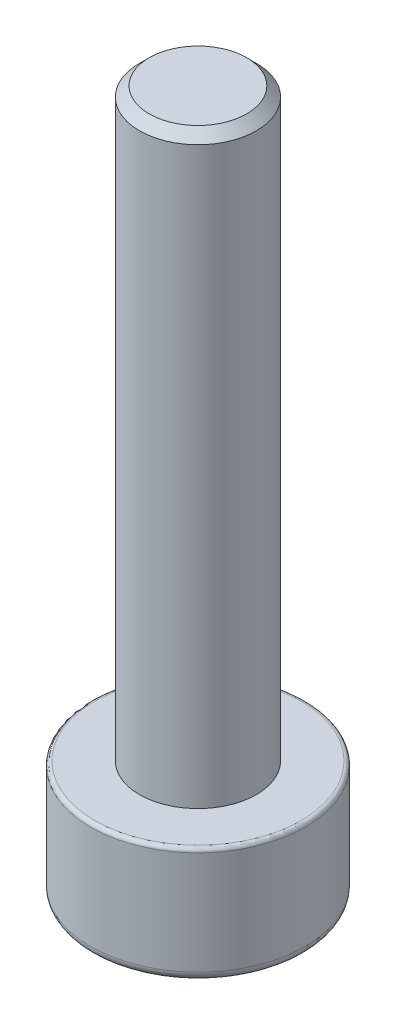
from build123d import *

# Parameters (mm, degrees)
SKETCH1_R           = 2.75
BOSS_EXTRUDE1_DEPTH = 3
SKETCH2_R           = 1.5
BOSS_EXTRUDE2_DEPTH = 15
CUT_EXTRUDE1_DEPTH  = 1.5
CHAMFER1_SIZE       = 0.25
FILLET1_R           = 0.25
CHAMFER2_SIZE       = 0.25
FILLET2_R           = 0.1


with BuildPart() as part:
    # Sketch1 → Boss-Extrude1 (new body)
    with BuildSketch(Plane(origin=(0, 0, 0), x_dir=(1, 0, 0), z_dir=(0, 1, 0))):
        with Locations(Location((0, 0, 0), (0, 0, 270))):
            Circle(SKETCH1_R)
    extrude(amount=BOSS_EXTRUDE1_DEPTH)

    # Sketch2 → Boss-Extrude2 (add)
    with BuildSketch(Plane(origin=(0, 3, 0), x_dir=(1, 0, 0), z_dir=(0, 1, 0))):
        with Locations(Location((0, 0, 0), (0, 0, 270))):
            Circle(SKETCH2_R)
    extrude(amount=BOSS_EXTRUDE2_DEPTH)

    # Sketch3 → Cut-Extrude1 (cut)
    with BuildSketch(Plane.XZ):
        Polygon((0.934168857, 0.974591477), (-0.376936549, 1.2963097), (-1.311105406, 0.321718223), (-0.934168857, -0.974591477), (0.376936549, -1.2963097), (1.311105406, -0.321718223), align=None)
    extrude(amount=-CUT_EXTRUDE1_DEPTH, mode=Mode.SUBTRACT)

    # Chamfer1
    chamfer1_edges = [part.edges().sort_by_distance(p)[0] for p in [
        (1.122637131, 0, 0.326436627),
        (0.278616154, 0, 1.135450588),
        (-0.844020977, 0, 0.809013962),
        (-1.122637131, 0, -0.326436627),
        (-0.278616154, 0, -1.135450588),
        (0.844020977, 0, -0.809013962),
    ]]
    chamfer(chamfer1_edges, length=CHAMFER1_SIZE)

    # Fillet1
    fillet1_edges = [part.edges().sort_by_distance(p)[0] for p in [
        (0, 0, -2.75),
    ]]
    fillet(fillet1_edges, radius=FILLET1_R)

    # Chamfer2
    chamfer2_edges = [part.edges().sort_by_distance(p)[0] for p in [
        (0, 18, -1.5),
    ]]
    chamfer(chamfer2_edges, length=CHAMFER2_SIZE)

    # Fillet2
    fillet2_edges = [part.edges().sort_by_distance(p)[0] for p in [
        (0, 3, -2.75),
    ]]
    fillet(fillet2_edges, radius=FILLET2_R)


solid = part.part
